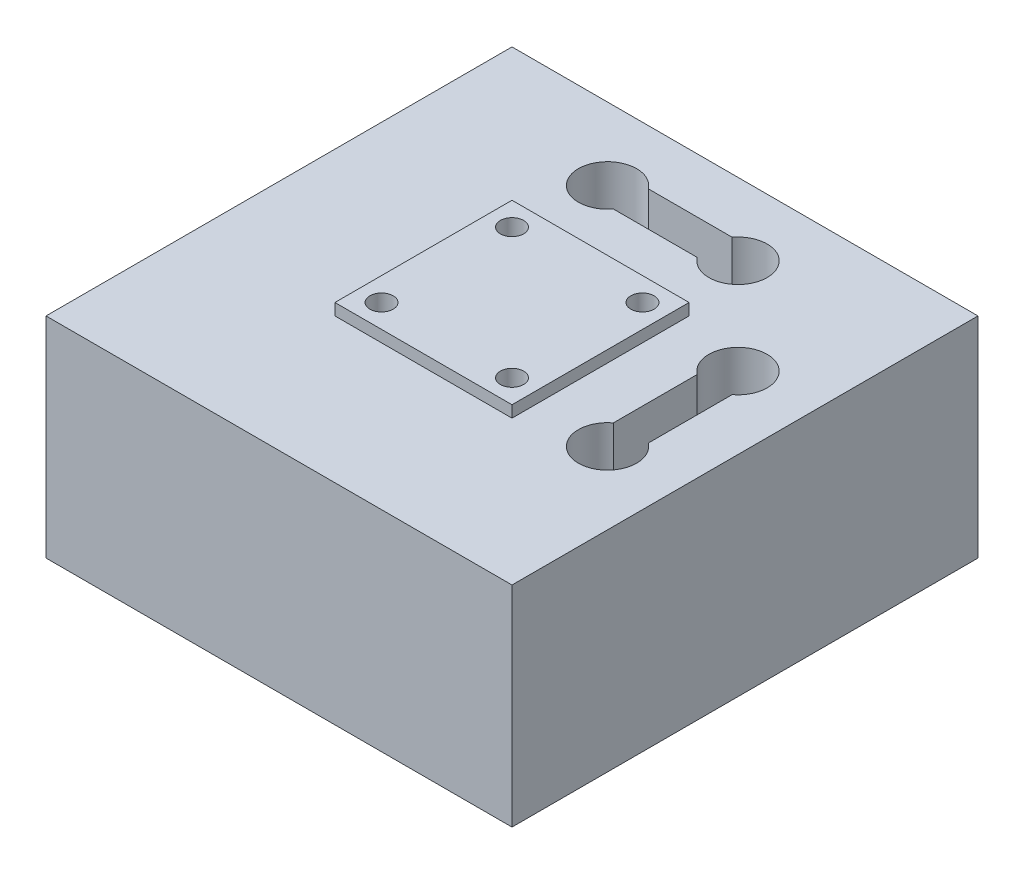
from build123d import *

# Parameters (mm, degrees)
SKETCH1_W                = 40
SKETCH1_H                = 40
BOSS_EXTRUDE1_DEPTH      = 18
BOSS_EXTRUDE2_DEPTH      = 1
BOSS_EXTRUDE2_DEPTH_BACK = 19
SKETCH2_W                = 15.2
SKETCH2_H                = 15.2
SKETCH3_R                = 1
CUT_EXTRUDE1_DEPTH       = 61


with BuildPart() as part:
    # Sketch1 → Boss-Extrude1 (new body)
    with BuildSketch(Plane(origin=(0, 0, 0), x_dir=(1, 0, 0), z_dir=(0, 1, 0))):
        with Locations((20, 20)):
            Rectangle(SKETCH1_W, SKETCH1_H)
    extrude(amount=BOSS_EXTRUDE1_DEPTH)

    # Sketch2 → Boss-Extrude2 (add, two sides: drawn at the far end of the back side and taken through both)
    with BuildSketch(Plane(origin=(0, 18, 0), x_dir=(1, 0, 0), z_dir=(0, 1, 0)).offset(-BOSS_EXTRUDE2_DEPTH_BACK)):
        with Locations((20, 20)):
            Rectangle(SKETCH2_W, SKETCH2_H)
    extrude(amount=BOSS_EXTRUDE2_DEPTH + BOSS_EXTRUDE2_DEPTH_BACK)

    # Sketch3 → Cut-Extrude1 (cut, through all)
    with BuildSketch(Plane(origin=(0, 19, 0), x_dir=(1, 0, 0), z_dir=(0, 1, 0))):
        with BuildLine():
            Line((14.4, 32.3), (14.4, 35.3))
            Line((14.4, 35.3), (16.4, 35.3))
            ThreePointArc((16.4, 35.3), (11.9, 33.8), (16.4, 32.3))
            Line((16.4, 32.3), (14.4, 32.3))
        make_face()
        with BuildLine():
            Line((16.4, 35.3), (14.4, 35.3))
            Line((14.4, 35.3), (14.4, 32.3))
            Line((14.4, 32.3), (16.4, 32.3))
            ThreePointArc((16.4, 32.3), (16.771708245, 33.009430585), (16.9, 33.8))
            ThreePointArc((16.9, 33.8), (16.771708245, 34.590569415), (16.4, 35.3))
        make_face()
        with BuildLine():
            Line((14.4, 32.3), (14.4, 35.3))
            Line((14.4, 35.3), (16.4, 35.3))
            ThreePointArc((16.4, 35.3), (11.9, 33.8), (16.4, 32.3))
            Line((16.4, 32.3), (14.4, 32.3))
        make_face()
        with BuildLine():
            Line((16.4, 35.3), (14.4, 35.3))
            Line((14.4, 35.3), (14.4, 32.3))
            Line((14.4, 32.3), (16.4, 32.3))
            ThreePointArc((16.4, 32.3), (16.771708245, 33.009430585), (16.9, 33.8))
            ThreePointArc((16.9, 33.8), (16.771708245, 34.590569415), (16.4, 35.3))
        make_face()
        with BuildLine():
            Line((23.6, 35.3), (16.4, 35.3))
            ThreePointArc((16.4, 35.3), (16.771708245, 34.590569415), (16.9, 33.8))
            ThreePointArc((16.9, 33.8), (16.771708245, 33.009430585), (16.4, 32.3))
            Line((16.4, 32.3), (23.6, 32.3))
            ThreePointArc((23.6, 32.3), (23.1, 33.8), (23.6, 35.3))
        make_face()
        with BuildLine():
            ThreePointArc((28.1, 33.8), (26.390569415, 36.171708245), (23.6, 35.3))
            Line((23.6, 35.3), (25.6, 35.3))
            Line((25.6, 35.3), (25.6, 32.3))
            Line((25.6, 32.3), (23.6, 32.3))
            ThreePointArc((23.6, 32.3), (26.390569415, 31.428291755), (28.1, 33.8))
        make_face()
        with BuildLine():
            Line((25.6, 35.3), (23.6, 35.3))
            ThreePointArc((23.6, 35.3), (23.1, 33.8), (23.6, 32.3))
            Line((23.6, 32.3), (25.6, 32.3))
            Line((25.6, 32.3), (25.6, 35.3))
        make_face()
        with BuildLine():
            ThreePointArc((28.1, 33.8), (26.390569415, 36.171708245), (23.6, 35.3))
            Line((23.6, 35.3), (25.6, 35.3))
            Line((25.6, 35.3), (25.6, 32.3))
            Line((25.6, 32.3), (23.6, 32.3))
            ThreePointArc((23.6, 32.3), (26.390569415, 31.428291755), (28.1, 33.8))
        make_face()
        with BuildLine():
            Line((25.6, 35.3), (23.6, 35.3))
            ThreePointArc((23.6, 35.3), (23.1, 33.8), (23.6, 32.3))
            Line((23.6, 32.3), (25.6, 32.3))
            Line((25.6, 32.3), (25.6, 35.3))
        make_face()
        with BuildLine():
            Line((32.3, 23.6), (32.3, 25.6))
            Line((32.3, 25.6), (35.3, 25.6))
            Line((35.3, 25.6), (35.3, 23.6))
            ThreePointArc((35.3, 23.6), (36.036067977, 24.481966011), (36.3, 25.6))
            ThreePointArc((36.3, 25.6), (32.681966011, 27.836067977), (32.3, 23.6))
        make_face()
        with BuildLine():
            Line((35.3, 25.6), (32.3, 25.6))
            Line((32.3, 25.6), (32.3, 23.6))
            ThreePointArc((32.3, 23.6), (33.8, 23.1), (35.3, 23.6))
            Line((35.3, 23.6), (35.3, 25.6))
        make_face()
        with BuildLine():
            Line((32.3, 23.6), (32.3, 25.6))
            Line((32.3, 25.6), (35.3, 25.6))
            Line((35.3, 25.6), (35.3, 23.6))
            ThreePointArc((35.3, 23.6), (36.036067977, 24.481966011), (36.3, 25.6))
            ThreePointArc((36.3, 25.6), (32.681966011, 27.836067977), (32.3, 23.6))
        make_face()
        with BuildLine():
            Line((35.3, 25.6), (32.3, 25.6))
            Line((32.3, 25.6), (32.3, 23.6))
            ThreePointArc((32.3, 23.6), (33.8, 23.1), (35.3, 23.6))
            Line((35.3, 23.6), (35.3, 25.6))
        make_face()
        with BuildLine():
            ThreePointArc((35.3, 23.6), (33.8, 23.1), (32.3, 23.6))
            Line((32.3, 23.6), (32.3, 16.4))
            ThreePointArc((32.3, 16.4), (33.8, 16.9), (35.3, 16.4))
            Line((35.3, 16.4), (35.3, 23.6))
        make_face()
        with BuildLine():
            ThreePointArc((35.3, 16.4), (33.8, 16.9), (32.3, 16.4))
            Line((32.3, 16.4), (32.3, 14.4))
            Line((32.3, 14.4), (35.3, 14.4))
            Line((35.3, 14.4), (35.3, 16.4))
        make_face()
        with BuildLine():
            Line((32.3, 14.4), (32.3, 16.4))
            ThreePointArc((32.3, 16.4), (32.681966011, 12.163932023), (36.3, 14.4))
            ThreePointArc((36.3, 14.4), (36.036067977, 15.518033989), (35.3, 16.4))
            Line((35.3, 16.4), (35.3, 14.4))
            Line((35.3, 14.4), (32.3, 14.4))
        make_face()
        with BuildLine():
            ThreePointArc((35.3, 16.4), (33.8, 16.9), (32.3, 16.4))
            Line((32.3, 16.4), (32.3, 14.4))
            Line((32.3, 14.4), (35.3, 14.4))
            Line((35.3, 14.4), (35.3, 16.4))
        make_face()
        with BuildLine():
            Line((32.3, 14.4), (32.3, 16.4))
            ThreePointArc((32.3, 16.4), (32.681966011, 12.163932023), (36.3, 14.4))
            ThreePointArc((36.3, 14.4), (36.036067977, 15.518033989), (35.3, 16.4))
            Line((35.3, 16.4), (35.3, 14.4))
            Line((35.3, 14.4), (32.3, 14.4))
        make_face()
        with Locations(Location((25.6, 14.4, 0), (0, 0, 270))):
            Circle(SKETCH3_R)
        with Locations(Location((25.6, 25.6, 0), (0, 0, 270))):
            Circle(SKETCH3_R)
        with Locations(Location((14.4, 25.6, 0), (0, 0, 270))):
            Circle(SKETCH3_R)
        with Locations(Location((14.4, 14.4, 0), (0, 0, 270))):
            Circle(SKETCH3_R)
    extrude(amount=-CUT_EXTRUDE1_DEPTH, mode=Mode.SUBTRACT)


solid = part.part
